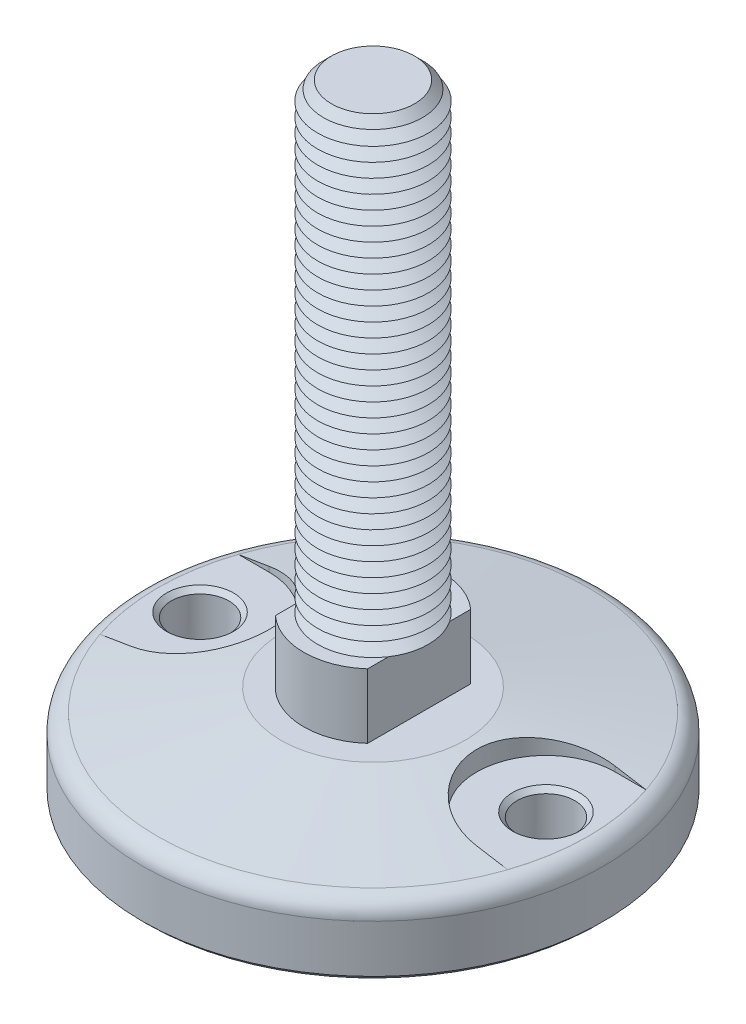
from build123d import *

# Parameters (mm, degrees)
FILLET1_R                = 4
SKETCH3_R                = 15
BOSS_EXTRUDE1_DEPTH      = 14
CUT_EXTRUDE1_START       = -14
CUT_EXTRUDE1_DEPTH       = 14
SKETCH5_R                = 12
BOSS_EXTRUDE2_DEPTH      = 100
CHAMFER1_SIZE            = 3
LPATTERN1_COUNT          = 33
LPATTERN1_PITCH          = 3
CUT_EXTRUDE4_DEPTH       = 4.7
SKETCH10_R               = 6.25
CUT_EXTRUDE5_DEPTH       = 15.3
CHAMFER2_SIZE            = 1
CHAMFER2_OF_MIRROR1_SIZE = 1
CHAMFER3_SIZE            = 1


with BuildPart() as part:
    # Sketch2 → Revolve1 (revolve)
    with BuildSketch(Plane(origin=(0, 0, 0), x_dir=(0, 0, -1), z_dir=(1, 0, 0))):
        Polygon((0, 0), (-20, 0), (-50, -5.289809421), (-50, -20), (0, -20), align=None)
    revolve(axis=Axis((0, 61.338865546, 0), (0, -1, 0)))

    # Fillet1
    fillet1_edges = [part.edges().sort_by_distance(p)[0] for p in [
        (0, -5.289809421, -50),
    ]]
    fillet(fillet1_edges, radius=FILLET1_R)

    # Sketch3 → Boss-Extrude1 (add)
    with BuildSketch(Plane(origin=(0, 0, 0), x_dir=(1, 0, 0), z_dir=(0, 1, 0))):
        with Locations(Location((0, 0, 0), (0, 0, 270))):
            Circle(SKETCH3_R)
    extrude(amount=BOSS_EXTRUDE1_DEPTH)

    # Sketch4 → Cut-Extrude1 (cut)
    with BuildSketch(Plane(origin=(0, 14, 0), x_dir=(1, 0, 0), z_dir=(0, 1, 0)).offset(CUT_EXTRUDE1_START)):
        with BuildLine():
            Line((-10, 11.180339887), (-10, -11.180339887))
            ThreePointArc((-10, -11.180339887), (-15, 0), (-10, 11.180339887))
        make_face()
        with BuildLine():
            Line((10, -11.180339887), (10, 11.180339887))
            ThreePointArc((10, 11.180339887), (15, 0), (10, -11.180339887))
        make_face()
    extrude(amount=CUT_EXTRUDE1_DEPTH, mode=Mode.SUBTRACT)

    # Sketch5 → Boss-Extrude2 (add)
    with BuildSketch(Plane(origin=(0, 14, 0), x_dir=(1, 0, 0), z_dir=(0, 1, 0))):
        with Locations(Location((0, 0, 0), (0, 0, 33.557309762))):
            Circle(SKETCH5_R)
    extrude(amount=BOSS_EXTRUDE2_DEPTH)

    # Chamfer1
    chamfer1_edges = [part.edges().sort_by_distance(p)[0] for p in [
        (-10, 114, 6.633249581),
    ]]
    chamfer(chamfer1_edges, length=CHAMFER1_SIZE)

    # Sketch6 → Cut-Revolve1 (revolve, cut)
    with BuildSketch(Plane(origin=(0, 0, 0), x_dir=(0, 0, -1), z_dir=(1, 0, 0))):
        Polygon((-12, 14), (-9.401923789, 15.5), (-12, 17), align=None)
    cut_revolve1 = revolve(axis=Axis((0, 61.338865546, 0), (0, -1, 0)), mode=Mode.SUBTRACT)

    # LPattern1: Cut-Revolve1 ×33
    with Locations(*[(0, i * LPATTERN1_PITCH, 0) for i in range(1, LPATTERN1_COUNT)]):
        add(cut_revolve1, mode=Mode.SUBTRACT)

    # Sketch8 → Cut-Extrude4 (cut)
    with BuildSketch(Plane(origin=(0, 0, 0), x_dir=(1, 0, 0), z_dir=(0, 1, 0))):
        with BuildLine():
            Line((-37.5, 15), (-44.219735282, 15))
            ThreePointArc((-44.219735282, 15), (-46.694592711, 0), (-44.219735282, -15))
            Line((-44.219735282, -15), (-37.5, -15))
            ThreePointArc((-37.5, -15), (-22.5, 0), (-37.5, 15))
        make_face()
    cut_extrude4 = extrude(amount=-CUT_EXTRUDE4_DEPTH, mode=Mode.SUBTRACT)

    # Sketch10 → Cut-Extrude5 (cut)
    with BuildSketch(Plane(origin=(0, -4.7, 0), x_dir=(1, 0, 0), z_dir=(0, 1, 0))):
        with Locations(Location((-37.5, 0, 0), (0, 0, 270))):
            Circle(SKETCH10_R)
    cut_extrude5 = extrude(amount=-CUT_EXTRUDE5_DEPTH, mode=Mode.SUBTRACT)

    # Chamfer2
    chamfer2_edges = [part.edges().sort_by_distance(p)[0] for p in [
        (-37.5, -4.7, -6.25),
        (-37.5, -20, -6.25),
    ]]
    chamfer(chamfer2_edges, length=CHAMFER2_SIZE)

    # Mirror1: Cut-Extrude4, Cut-Extrude5 across plane
    add(cut_extrude4.mirror(Plane(origin=(0, 0, 0), x_dir=(0, 0, 1), z_dir=(1, 0, 0))), mode=Mode.SUBTRACT)
    add(cut_extrude5.mirror(Plane(origin=(0, 0, 0), x_dir=(0, 0, 1), z_dir=(1, 0, 0))), mode=Mode.SUBTRACT)

    # Chamfer2 of Mirror1
    chamfer2_of_mirror1_edges = [part.edges().sort_by_distance(p)[0] for p in [
        (37.5, -4.7, -6.25),
        (37.5, -20, -6.25),
    ]]
    chamfer(chamfer2_of_mirror1_edges, length=CHAMFER2_OF_MIRROR1_SIZE)

    # Chamfer3
    chamfer3_edges = [part.edges().sort_by_distance(p)[0] for p in [
        (0, -20, -50),
    ]]
    chamfer(chamfer3_edges, length=CHAMFER3_SIZE)


solid = part.part
